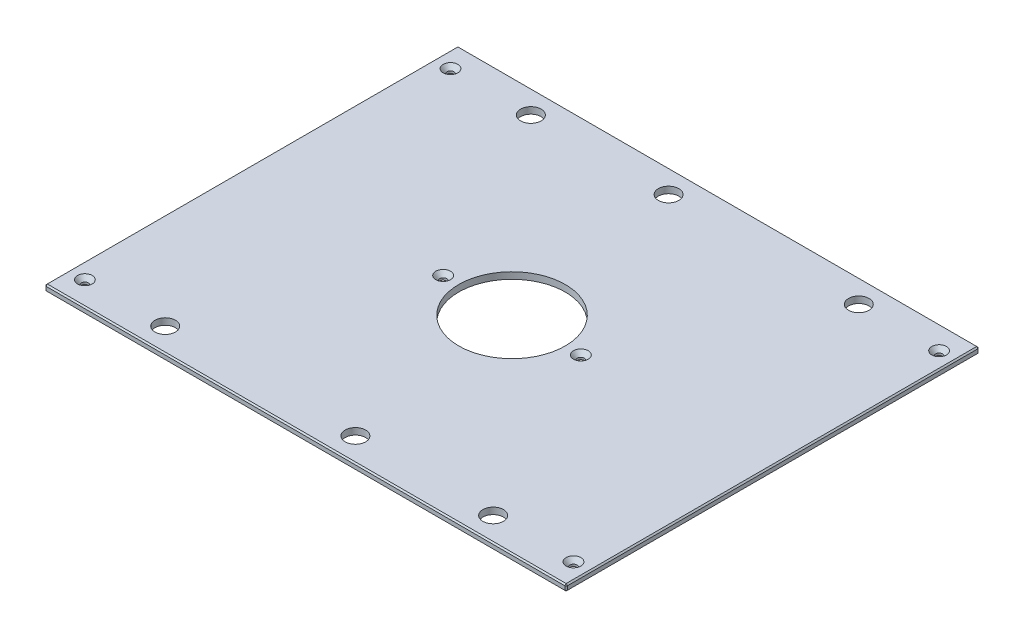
from build123d import *

# Parameters (mm, degrees)
SKETCH1_W                                     = 504.825
SKETCH1_H                                     = 400.05
BOSS_EXTRUDE1_DEPTH                           = 6.35
SKETCH13_R                                    = 51.562
CUT_EXTRUDE6_DEPTH                            = 323.121705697
F_25_32_0_78125_DIAMETER_HOLE1_D              = 19.84375
CHAMFER2_SIZE                                 = 1.27
CSK_FOR_1_4_FLAT_HEAD_MACHINE_SCREW1_AT_COUNT = 2
CSK_FOR_1_4_FLAT_HEAD_MACHINE_SCREW1_AT_PITCH = 354.00996
CSK_FOR_1_4_FLAT_HEAD_MACHINE_SCREW1_2_COUNT  = 2
CSK_FOR_1_4_FLAT_HEAD_MACHINE_SCREW1_2_PITCH  = 590.866319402
CSK_FOR_1_4_FLAT_HEAD_MACHINE_SCREW1_3_COUNT  = 2
CSK_FOR_1_4_FLAT_HEAD_MACHINE_SCREW1_3_PITCH  = 351.096259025
CSK_FOR_1_4_FLAT_HEAD_MACHINE_SCREW1_4_COUNT  = 2
CSK_FOR_1_4_FLAT_HEAD_MACHINE_SCREW1_4_PITCH  = 245.324340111
CSK_FOR_1_4_FLAT_HEAD_MACHINE_SCREW1_5_COUNT  = 2
CSK_FOR_1_4_FLAT_HEAD_MACHINE_SCREW1_5_PITCH  = 473.075
CSK_FOR_1_4_FLAT_HEAD_MACHINE_SCREW1_6_COUNT  = 2
CSK_FOR_1_4_FLAT_HEAD_MACHINE_SCREW1_6_PITCH  = 395.2875
CSK_FOR_1_4_FLAT_HEAD_MACHINE_SCREW1_7_COUNT  = 2
CSK_FOR_1_4_FLAT_HEAD_MACHINE_SCREW1_7_PITCH  = 530.636654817


with BuildPart() as part:
    # Sketch1 → Boss-Extrude1 (new body)
    with BuildSketch(Plane(origin=(0, 0, 0), x_dir=(1, 0, 0), z_dir=(0, 1, 0))):
        Rectangle(SKETCH1_W, SKETCH1_H)
    extrude(amount=BOSS_EXTRUDE1_DEPTH)

    # Sketch13 → Cut-Extrude6 (cut, through all)
    with BuildSketch(Plane(origin=(0, 6.35, 0), x_dir=(1, 0, 0), z_dir=(0, 1, 0))):
        with Locations(Location((0, 0, 0), (0, 0, 270))):
            Circle(SKETCH13_R)
    extrude(amount=-CUT_EXTRUDE6_DEPTH, mode=Mode.SUBTRACT)

    # 25_32 _0.78125_ Diameter Hole1 (through all)
    with Locations(Plane(origin=(0, 6.35, 0), x_dir=(1, 0, 0), z_dir=(0, 1, 0))):
        with Locations((158.75, 177.00498), (-158.75, 177.00498), (158.75, -177.00498), (-158.75, -177.00498), (-25.4, 177.00498), (25.4, -177.00498)):
            Hole(F_25_32_0_78125_DIAMETER_HOLE1_D / 2)

    # Chamfer2
    chamfer2_edges = [part.edges().sort_by_distance(p)[0] for p in [
        (252.4125, 6.35, 0),
        (0, 6.35, -200.025),
        (-252.4125, 6.35, 0),
        (0, 0, -200.025),
        (252.4125, 0, 0),
        (0, 0, 200.025),
        (-252.4125, 0, 0),
        (0, 6.35, 200.025),
        (-252.4125, 3.175, -200.025),
        (252.4125, 3.175, -200.025),
        (252.4125, 3.175, 200.025),
        (-252.4125, 3.175, 200.025),
    ]]
    chamfer(chamfer2_edges, length=CHAMFER2_SIZE)

    # Sketch24 → CSK for 1_4 Flat Head Machine Screw1 (revolve, cut)
    with BuildSketch(Plane(origin=(236.5375, 6.35, -177.00498), x_dir=(0, 0, 1), z_dir=(1, 0, 0))):
        Polygon((0, 0), (0, 6.35), (3.3782, 6.35), (3.3782, 4.324464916), (7.1374, 0), align=None)
    csk_for_1_4_flat_head_machine_screw1 = revolve(axis=Axis((236.5375, 12.7, -177.00498), (0, -1, 0)), mode=Mode.SUBTRACT)

    # CSK for 1_4 Flat Head Machine Screw1 at: CSK for 1_4 Flat Head Machine Screw1 ×2
    with Locations(*[(0, 0, i * CSK_FOR_1_4_FLAT_HEAD_MACHINE_SCREW1_AT_PITCH) for i in range(1, CSK_FOR_1_4_FLAT_HEAD_MACHINE_SCREW1_AT_COUNT)]):
        add(csk_for_1_4_flat_head_machine_screw1, mode=Mode.SUBTRACT)

    # CSK for 1_4 Flat Head Machine Screw1 2: CSK for 1_4 Flat Head Machine Screw1 ×2
    with Locations(*[Vector(-0.8006464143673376, 0, 0.5991371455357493) * (i * CSK_FOR_1_4_FLAT_HEAD_MACHINE_SCREW1_2_PITCH) for i in range(1, CSK_FOR_1_4_FLAT_HEAD_MACHINE_SCREW1_2_COUNT)]):
        add(csk_for_1_4_flat_head_machine_screw1, mode=Mode.SUBTRACT)

    # CSK for 1_4 Flat Head Machine Screw1 3: CSK for 1_4 Flat Head Machine Screw1 ×2
    with Locations(*[Vector(-0.8636164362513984, 0, 0.5041494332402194) * (i * CSK_FOR_1_4_FLAT_HEAD_MACHINE_SCREW1_3_PITCH) for i in range(1, CSK_FOR_1_4_FLAT_HEAD_MACHINE_SCREW1_3_COUNT)]):
        add(csk_for_1_4_flat_head_machine_screw1, mode=Mode.SUBTRACT)

    # CSK for 1_4 Flat Head Machine Screw1 4: CSK for 1_4 Flat Head Machine Screw1 ×2
    with Locations(*[Vector(-0.6923997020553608, 0, 0.7215141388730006) * (i * CSK_FOR_1_4_FLAT_HEAD_MACHINE_SCREW1_4_PITCH) for i in range(1, CSK_FOR_1_4_FLAT_HEAD_MACHINE_SCREW1_4_COUNT)]):
        add(csk_for_1_4_flat_head_machine_screw1, mode=Mode.SUBTRACT)

    # CSK for 1_4 Flat Head Machine Screw1 5: CSK for 1_4 Flat Head Machine Screw1 ×2
    with Locations(*[(-i * CSK_FOR_1_4_FLAT_HEAD_MACHINE_SCREW1_5_PITCH, 0, 0) for i in range(1, CSK_FOR_1_4_FLAT_HEAD_MACHINE_SCREW1_5_COUNT)]):
        add(csk_for_1_4_flat_head_machine_screw1, mode=Mode.SUBTRACT)

    # CSK for 1_4 Flat Head Machine Screw1 6: CSK for 1_4 Flat Head Machine Screw1 ×2
    with Locations(*[(-i * CSK_FOR_1_4_FLAT_HEAD_MACHINE_SCREW1_6_PITCH, 0, 0) for i in range(1, CSK_FOR_1_4_FLAT_HEAD_MACHINE_SCREW1_6_COUNT)]):
        add(csk_for_1_4_flat_head_machine_screw1, mode=Mode.SUBTRACT)

    # CSK for 1_4 Flat Head Machine Screw1 7: CSK for 1_4 Flat Head Machine Screw1 ×2
    with Locations(*[Vector(-0.7449306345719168, 0, 0.6671419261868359) * (i * CSK_FOR_1_4_FLAT_HEAD_MACHINE_SCREW1_7_PITCH) for i in range(1, CSK_FOR_1_4_FLAT_HEAD_MACHINE_SCREW1_7_COUNT)]):
        add(csk_for_1_4_flat_head_machine_screw1, mode=Mode.SUBTRACT)


solid = part.part
